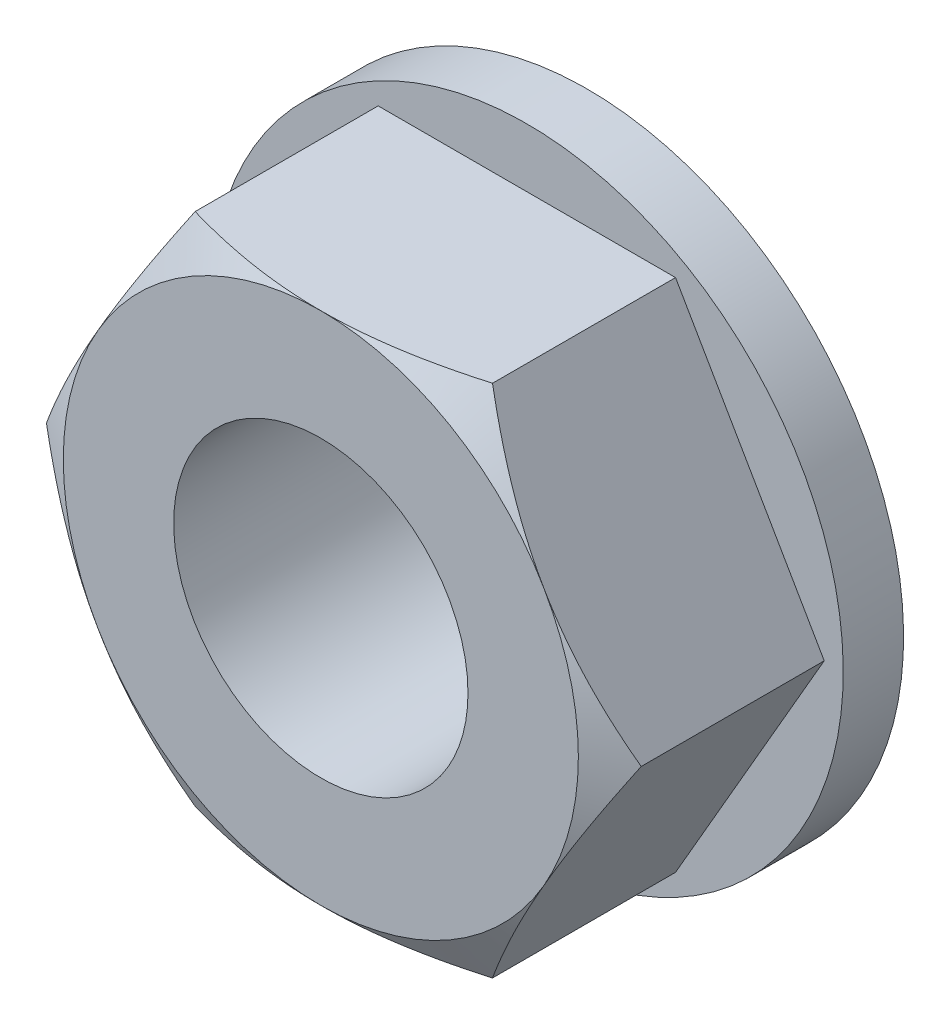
ISO-10303-21;
HEADER;
FILE_DESCRIPTION(('STEP AP214'),'2;1');
FILE_NAME('part.step','',(''),(''),'','','');
FILE_SCHEMA(('AUTOMOTIVE_DESIGN { 1 0 10303 214 1 1 1 1 }'));
ENDSEC;
DATA;
#1=APPLICATION_CONTEXT('core data for automotive mechanical design processes');
#2=APPLICATION_PROTOCOL_DEFINITION('international standard','automotive_design',2000,#1);
#3=PRODUCT_CONTEXT('',#1,'mechanical');
#4=PRODUCT('Part','Part','',(#3));
#5=PRODUCT_RELATED_PRODUCT_CATEGORY('part','',(#4));
#6=PRODUCT_DEFINITION_FORMATION('','',#4);
#7=PRODUCT_DEFINITION_CONTEXT('part definition',#1,'design');
#8=PRODUCT_DEFINITION('design','',#6,#7);
#9=PRODUCT_DEFINITION_SHAPE('','',#8);
#10=(LENGTH_UNIT() NAMED_UNIT(*) SI_UNIT(.MILLI.,.METRE.));
#11=(NAMED_UNIT(*) PLANE_ANGLE_UNIT() SI_UNIT($,.RADIAN.));
#12=(NAMED_UNIT(*) SI_UNIT($,.STERADIAN.) SOLID_ANGLE_UNIT());
#13=UNCERTAINTY_MEASURE_WITH_UNIT(LENGTH_MEASURE(1.E-05),#10,'distance_accuracy_value','');
#14=(GEOMETRIC_REPRESENTATION_CONTEXT(3) GLOBAL_UNCERTAINTY_ASSIGNED_CONTEXT((#13)) GLOBAL_UNIT_ASSIGNED_CONTEXT((#10,
#11,#12)) REPRESENTATION_CONTEXT('',''));
#15=CARTESIAN_POINT('',(0.,0.,0.));
#16=DIRECTION('',(0.,0.,1.));
#17=DIRECTION('',(1.,0.,0.));
#18=AXIS2_PLACEMENT_3D('',#15,#16,#17);
#19=CARTESIAN_POINT('',(0.,0.,0.));
#20=DIRECTION('',(0.,0.,1.));
#21=DIRECTION('',(-0.999860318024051,-0.0167136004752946,0.));
#22=AXIS2_PLACEMENT_3D('',#19,#20,#21);
#23=PLANE('',#22);
#24=CARTESIAN_POINT('',(0.,0.,0.));
#25=DIRECTION('',(0.,0.,-1.));
#26=DIRECTION('',(0.999860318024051,0.0167136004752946,0.));
#27=AXIS2_PLACEMENT_3D('',#24,#25,#26);
#28=CIRCLE('',#27,2.2);
#29=CARTESIAN_POINT('',(2.19969269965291,0.0367699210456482,0.));
#30=VERTEX_POINT('',#29);
#31=EDGE_CURVE('E257',#30,#30,#28,.F.);
#32=ORIENTED_EDGE('',*,*,#31,.T.);
#33=EDGE_LOOP('',(#32));
#34=FACE_BOUND('',#33,.T.);
#35=CARTESIAN_POINT('',(0.,0.,0.));
#36=DIRECTION('',(0.,0.,-1.));
#37=DIRECTION('',(0.999860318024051,0.0167136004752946,0.));
#38=AXIS2_PLACEMENT_3D('',#35,#36,#37);
#39=CIRCLE('',#38,4.3);
#40=CARTESIAN_POINT('',(4.29939936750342,0.071868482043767,0.));
#41=VERTEX_POINT('',#40);
#42=EDGE_CURVE('E20',#41,#41,#39,.F.);
#43=ORIENTED_EDGE('',*,*,#42,.F.);
#44=EDGE_LOOP('',(#43));
#45=FACE_BOUND('',#44,.T.);
#46=ADVANCED_FACE('F17',(#34,#45),#23,.F.);
#47=CARTESIAN_POINT('',(0.,0.,0.82));
#48=DIRECTION('',(0.,0.,-1.));
#49=DIRECTION('',(0.999860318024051,0.0167136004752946,0.));
#50=AXIS2_PLACEMENT_3D('',#47,#48,#49);
#51=CYLINDRICAL_SURFACE('',#50,2.2);
#52=CARTESIAN_POINT('',(0.,0.,0.42));
#53=DIRECTION('',(0.,0.,-1.));
#54=DIRECTION('',(0.,1.,0.));
#55=AXIS2_PLACEMENT_3D('',#52,#53,#54);
#56=CIRCLE('',#55,2.2);
#57=CARTESIAN_POINT('',(0.,2.2,0.419999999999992));
#58=VERTEX_POINT('',#57);
#59=EDGE_CURVE('E11',#58,#58,#56,.T.);
#60=ORIENTED_EDGE('',*,*,#59,.F.);
#61=EDGE_LOOP('',(#60));
#62=FACE_BOUND('',#61,.T.);
#63=ORIENTED_EDGE('',*,*,#31,.F.);
#64=EDGE_LOOP('',(#63));
#65=FACE_BOUND('',#64,.T.);
#66=ADVANCED_FACE('F452',(#62,#65),#51,.F.);
#67=CARTESIAN_POINT('',(0.,0.,0.82));
#68=DIRECTION('',(0.,0.,-1.));
#69=DIRECTION('',(0.999860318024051,0.0167136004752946,0.));
#70=AXIS2_PLACEMENT_3D('',#67,#68,#69);
#71=CYLINDRICAL_SURFACE('',#70,4.3);
#72=ORIENTED_EDGE('',*,*,#42,.T.);
#73=EDGE_LOOP('',(#72));
#74=FACE_BOUND('',#73,.T.);
#75=CARTESIAN_POINT('',(0.,0.,0.82));
#76=DIRECTION('',(0.,0.,-1.));
#77=DIRECTION('',(0.999860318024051,0.0167136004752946,0.));
#78=AXIS2_PLACEMENT_3D('',#75,#76,#77);
#79=CIRCLE('',#78,4.3);
#80=CARTESIAN_POINT('',(4.29939936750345,0.0718684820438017,0.819999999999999));
#81=VERTEX_POINT('',#80);
#82=EDGE_CURVE('E475',#81,#81,#79,.F.);
#83=ORIENTED_EDGE('',*,*,#82,.F.);
#84=EDGE_LOOP('',(#83));
#85=FACE_BOUND('',#84,.T.);
#86=ADVANCED_FACE('F246',(#74,#85),#71,.T.);
#87=CARTESIAN_POINT('',(0.,0.,0.82));
#88=DIRECTION('',(0.,0.,1.));
#89=DIRECTION('',(-0.999860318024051,-0.0167136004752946,0.));
#90=AXIS2_PLACEMENT_3D('',#87,#88,#89);
#91=PLANE('',#90);
#92=ORIENTED_EDGE('',*,*,#82,.T.);
#93=EDGE_LOOP('',(#92));
#94=FACE_BOUND('',#93,.T.);
#95=DIRECTION('',(-0.5,0.866025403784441,0.));
#96=VECTOR('',#95,1.);
#97=CARTESIAN_POINT('',(4.04145188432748,0.,0.820000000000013));
#98=LINE('',#97,#96);
#99=CARTESIAN_POINT('',(4.04145188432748,0.,0.820000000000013));
#100=VERTEX_POINT('',#99);
#101=CARTESIAN_POINT('',(2.02072594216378,3.50000000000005,0.819999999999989));
#102=VERTEX_POINT('',#101);
#103=EDGE_CURVE('E285',#100,#102,#98,.T.);
#104=ORIENTED_EDGE('',*,*,#103,.F.);
#105=DIRECTION('',(0.5,0.866025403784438,0.));
#106=VECTOR('',#105,1.);
#107=CARTESIAN_POINT('',(4.04145188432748,0.,0.820000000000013));
#108=LINE('',#107,#106);
#109=CARTESIAN_POINT('',(2.02072594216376,-3.5,0.819999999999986));
#110=VERTEX_POINT('',#109);
#111=EDGE_CURVE('E280',#100,#110,#108,.F.);
#112=ORIENTED_EDGE('',*,*,#111,.T.);
#113=DIRECTION('',(1.,0.,0.));
#114=VECTOR('',#113,1.);
#115=CARTESIAN_POINT('',(-2.02072594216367,-3.5,0.82));
#116=LINE('',#115,#114);
#117=CARTESIAN_POINT('',(-2.02072594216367,-3.5,0.82));
#118=VERTEX_POINT('',#117);
#119=EDGE_CURVE('E275',#118,#110,#116,.T.);
#120=ORIENTED_EDGE('',*,*,#119,.F.);
#121=DIRECTION('',(0.5,-0.866025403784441,0.));
#122=VECTOR('',#121,1.);
#123=CARTESIAN_POINT('',(-4.04145188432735,0.,0.820000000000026));
#124=LINE('',#123,#122);
#125=CARTESIAN_POINT('',(-4.04145188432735,0.,0.820000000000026));
#126=VERTEX_POINT('',#125);
#127=EDGE_CURVE('E270',#126,#118,#124,.T.);
#128=ORIENTED_EDGE('',*,*,#127,.F.);
#129=DIRECTION('',(0.5,0.866025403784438,0.));
#130=VECTOR('',#129,1.);
#131=CARTESIAN_POINT('',(-2.02072594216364,3.5,0.819999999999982));
#132=LINE('',#131,#130);
#133=CARTESIAN_POINT('',(-2.02072594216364,3.5,0.819999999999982));
#134=VERTEX_POINT('',#133);
#135=EDGE_CURVE('E265',#134,#126,#132,.F.);
#136=ORIENTED_EDGE('',*,*,#135,.F.);
#137=DIRECTION('',(-1.,0.,0.));
#138=VECTOR('',#137,1.);
#139=CARTESIAN_POINT('',(2.02072594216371,3.50000000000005,0.819999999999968));
#140=LINE('',#139,#138);
#141=EDGE_CURVE('E91',#102,#134,#140,.T.);
#142=ORIENTED_EDGE('',*,*,#141,.F.);
#143=EDGE_LOOP('',(#104,#112,#120,#128,#136,#142));
#144=FACE_BOUND('',#143,.T.);
#145=ADVANCED_FACE('F238',(#94,#144),#91,.T.);
#146=CARTESIAN_POINT('',(0.,0.,-21.4175057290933));
#147=DIRECTION('',(0.,0.,1.));
#148=DIRECTION('',(0.866025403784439,-0.5,0.));
#149=AXIS2_PLACEMENT_3D('',#146,#147,#148);
#150=CYLINDRICAL_SURFACE('',#149,2.);
#151=CARTESIAN_POINT('',(0.,0.,0.42));
#152=DIRECTION('',(0.,0.,1.));
#153=DIRECTION('',(0.866025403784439,-0.5,0.));
#154=AXIS2_PLACEMENT_3D('',#151,#152,#153);
#155=CIRCLE('',#154,2.);
#156=CARTESIAN_POINT('',(1.7320508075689,-0.999999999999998,0.420000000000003));
#157=VERTEX_POINT('',#156);
#158=EDGE_CURVE('E156',#157,#157,#155,.T.);
#159=ORIENTED_EDGE('',*,*,#158,.F.);
#160=EDGE_LOOP('',(#159));
#161=FACE_BOUND('',#160,.T.);
#162=CARTESIAN_POINT('',(1.52655665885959E-13,0.,3.62));
#163=DIRECTION('',(0.,0.,1.));
#164=DIRECTION('',(1.,0.,0.));
#165=AXIS2_PLACEMENT_3D('',#162,#163,#164);
#166=CIRCLE('',#165,2.);
#167=CARTESIAN_POINT('',(2.00000000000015,0.,3.62));
#168=VERTEX_POINT('',#167);
#169=EDGE_CURVE('E254',#168,#168,#166,.T.);
#170=ORIENTED_EDGE('',*,*,#169,.T.);
#171=EDGE_LOOP('',(#170));
#172=FACE_BOUND('',#171,.T.);
#173=ADVANCED_FACE('F164',(#161,#172),#150,.F.);
#174=CARTESIAN_POINT('',(2.02072594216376,3.5,0.419999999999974));
#175=DIRECTION('',(0.,0.,-1.));
#176=DIRECTION('',(-0.866025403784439,0.5,0.));
#177=AXIS2_PLACEMENT_3D('',#174,#175,#176);
#178=PLANE('',#177);
#179=ORIENTED_EDGE('',*,*,#158,.T.);
#180=EDGE_LOOP('',(#179));
#181=FACE_BOUND('',#180,.T.);
#182=ORIENTED_EDGE('',*,*,#59,.T.);
#183=EDGE_LOOP('',(#182));
#184=FACE_BOUND('',#183,.T.);
#185=ADVANCED_FACE('F237',(#181,#184),#178,.T.);
#186=CARTESIAN_POINT('',(2.02072594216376,3.5,3.62));
#187=DIRECTION('',(0.,0.,-1.));
#188=DIRECTION('',(-0.866025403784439,0.5,0.));
#189=AXIS2_PLACEMENT_3D('',#186,#187,#188);
#190=PLANE('',#189);
#191=CARTESIAN_POINT('',(1.38777878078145E-13,0.,3.62000000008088));
#192=DIRECTION('',(0.,0.,-1.));
#193=DIRECTION('',(-0.866025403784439,0.5,0.));
#194=AXIS2_PLACEMENT_3D('',#191,#192,#193);
#195=CIRCLE('',#194,3.49999999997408);
#196=CARTESIAN_POINT('',(-3.03108891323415,-1.74999999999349,3.62000000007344));
#197=VERTEX_POINT('',#196);
#198=CARTESIAN_POINT('',(-3.03108891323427,1.74999999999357,3.62000000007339));
#199=VERTEX_POINT('',#198);
#200=EDGE_CURVE('E312',#197,#199,#195,.T.);
#201=ORIENTED_EDGE('',*,*,#200,.F.);
#202=CARTESIAN_POINT('',(1.38777878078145E-13,0.,3.62000000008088));
#203=DIRECTION('',(0.,0.,-1.));
#204=DIRECTION('',(-0.866025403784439,0.5,0.));
#205=AXIS2_PLACEMENT_3D('',#202,#203,#204);
#206=CIRCLE('',#205,3.49999999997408);
#207=CARTESIAN_POINT('',(1.45716771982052E-13,-3.49999999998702,3.62000000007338));
#208=VERTEX_POINT('',#207);
#209=EDGE_CURVE('E315',#208,#197,#206,.T.);
#210=ORIENTED_EDGE('',*,*,#209,.F.);
#211=CARTESIAN_POINT('',(1.38777878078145E-13,0.,3.62000000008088));
#212=DIRECTION('',(0.,0.,-1.));
#213=DIRECTION('',(-0.866025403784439,0.5,0.));
#214=AXIS2_PLACEMENT_3D('',#211,#212,#213);
#215=CIRCLE('',#214,3.49999999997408);
#216=CARTESIAN_POINT('',(3.03108891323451,-1.74999999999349,3.62000000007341));
#217=VERTEX_POINT('',#216);
#218=EDGE_CURVE('E104',#217,#208,#215,.T.);
#219=ORIENTED_EDGE('',*,*,#218,.F.);
#220=CARTESIAN_POINT('',(1.38777878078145E-13,0.,3.62000000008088));
#221=DIRECTION('',(0.,0.,-1.));
#222=DIRECTION('',(-0.866025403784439,0.5,0.));
#223=AXIS2_PLACEMENT_3D('',#220,#221,#222);
#224=CIRCLE('',#223,3.49999999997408);
#225=CARTESIAN_POINT('',(3.0310889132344,1.74999999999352,3.62000000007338));
#226=VERTEX_POINT('',#225);
#227=EDGE_CURVE('E73',#226,#217,#224,.T.);
#228=ORIENTED_EDGE('',*,*,#227,.F.);
#229=CARTESIAN_POINT('',(1.38777878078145E-13,0.,3.62000000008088));
#230=DIRECTION('',(0.,0.,-1.));
#231=DIRECTION('',(-0.866025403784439,0.5,0.));
#232=AXIS2_PLACEMENT_3D('',#229,#230,#231);
#233=CIRCLE('',#232,3.49999999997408);
#234=CARTESIAN_POINT('',(0.,3.49999999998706,3.62000000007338));
#235=VERTEX_POINT('',#234);
#236=EDGE_CURVE('E100',#235,#226,#233,.T.);
#237=ORIENTED_EDGE('',*,*,#236,.F.);
#238=CARTESIAN_POINT('',(1.38777878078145E-13,0.,3.62000000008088));
#239=DIRECTION('',(0.,0.,-1.));
#240=DIRECTION('',(-0.866025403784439,0.5,0.));
#241=AXIS2_PLACEMENT_3D('',#238,#239,#240);
#242=CIRCLE('',#241,3.49999999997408);
#243=EDGE_CURVE('E26',#199,#235,#242,.T.);
#244=ORIENTED_EDGE('',*,*,#243,.F.);
#245=EDGE_LOOP('',(#201,#210,#219,#228,#237,#244));
#246=FACE_BOUND('',#245,.T.);
#247=ORIENTED_EDGE('',*,*,#169,.F.);
#248=EDGE_LOOP('',(#247));
#249=FACE_BOUND('',#248,.T.);
#250=ADVANCED_FACE('F97',(#246,#249),#190,.F.);
#251=CARTESIAN_POINT('',(1.52655665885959E-13,0.,3.3055169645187));
#252=DIRECTION('',(0.,0.,-1.));
#253=DIRECTION('',(-0.866025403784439,0.5,0.));
#254=AXIS2_PLACEMENT_3D('',#251,#252,#253);
#255=CONICAL_SURFACE('',#254,4.04470059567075,1.04719755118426);
#256=CARTESIAN_POINT('',(3.03108891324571,-1.74999999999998,3.62000000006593));
#257=CARTESIAN_POINT('',(3.07397315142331,-1.67572232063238,3.62001430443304));
#258=CARTESIAN_POINT('',(3.11685532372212,-1.60144821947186,3.61818014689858));
#259=CARTESIAN_POINT('',(3.20253546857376,-1.45304585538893,3.61092122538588));
#260=CARTESIAN_POINT('',(3.24533345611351,-1.37891756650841,3.60549717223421));
#261=CARTESIAN_POINT('',(3.33056879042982,-1.23128563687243,3.59120049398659));
#262=CARTESIAN_POINT('',(3.37300687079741,-1.15778072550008,3.58234522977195));
#263=CARTESIAN_POINT('',(3.45768084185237,-1.01112110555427,3.56137660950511));
#264=CARTESIAN_POINT('',(3.49991672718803,-0.937966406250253,3.54926316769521));
#265=CARTESIAN_POINT('',(3.62614601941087,-0.719330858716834,3.50840979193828));
#266=CARTESIAN_POINT('',(3.70977272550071,-0.574485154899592,3.47513697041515));
#267=CARTESIAN_POINT('',(3.87630698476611,-0.286039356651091,3.39840133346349));
#268=CARTESIAN_POINT('',(3.95920872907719,-0.14244932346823,3.35488762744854));
#269=CARTESIAN_POINT('',(4.04145184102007,-7.50106261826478E-08,3.30739263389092));
#270=B_SPLINE_CURVE_WITH_KNOTS('',3,(#256,#257,#258,#259,#260,#261,#262,#263,#264,#265,#266,
#267,#268,#269),.UNSPECIFIED.,.F.,.F.,(4,2,2,2,2,2,4),(0.,0.257279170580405,0.514507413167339,
0.77045080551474,1.02640093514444,1.537630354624,2.05145599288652),.UNSPECIFIED.);
#271=CARTESIAN_POINT('',(4.04145186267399,-3.75049696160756E-08,3.30739262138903));
#272=VERTEX_POINT('',#271);
#273=EDGE_CURVE('E75',#217,#272,#270,.T.);
#274=ORIENTED_EDGE('',*,*,#273,.T.);
#275=CARTESIAN_POINT('',(4.04145190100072,-2.88788541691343E-08,3.30739259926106));
#276=CARTESIAN_POINT('',(3.95920878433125,0.142449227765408,3.35488759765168));
#277=CARTESIAN_POINT('',(3.87630703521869,0.286039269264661,3.3984013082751));
#278=CARTESIAN_POINT('',(3.70977276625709,0.574485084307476,3.47513695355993));
#279=CARTESIAN_POINT('',(3.62614605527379,0.719330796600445,3.50840977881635));
#280=CARTESIAN_POINT('',(3.49991675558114,0.937966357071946,3.54926315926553));
#281=CARTESIAN_POINT('',(3.45768086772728,1.01112106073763,3.56137660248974));
#282=CARTESIAN_POINT('',(3.37300689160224,1.15778068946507,3.58234522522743));
#283=CARTESIAN_POINT('',(3.33056880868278,1.23128560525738,3.59120049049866));
#284=CARTESIAN_POINT('',(3.24533346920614,1.37891754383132,3.60549717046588));
#285=CARTESIAN_POINT('',(3.20253547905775,1.45304583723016,3.61092122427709));
#286=CARTESIAN_POINT('',(3.11685532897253,1.60144821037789,3.6181801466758));
#287=CARTESIAN_POINT('',(3.07397315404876,1.67572231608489,3.62001430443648));
#288=CARTESIAN_POINT('',(3.03108891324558,1.75,3.6200000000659));
#289=B_SPLINE_CURVE_WITH_KNOTS('',3,(#275,#276,#277,#278,#279,#280,#281,#282,#283,#284,#285,
#286,#287,#288),.UNSPECIFIED.,.F.,.F.,(4,2,2,2,2,2,4),(0.,0.513825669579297,1.02505511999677,
1.28100526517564,1.53694867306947,1.79417693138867,2.05145611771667),.UNSPECIFIED.);
#290=EDGE_CURVE('E69',#272,#226,#289,.T.);
#291=ORIENTED_EDGE('',*,*,#290,.T.);
#292=ORIENTED_EDGE('',*,*,#227,.T.);
#293=EDGE_LOOP('',(#274,#291,#292));
#294=FACE_BOUND('',#293,.T.);
#295=ADVANCED_FACE('F71',(#294),#255,.T.);
#296=CARTESIAN_POINT('',(1.52655665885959E-13,0.,3.3055169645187));
#297=DIRECTION('',(0.,0.,-1.));
#298=DIRECTION('',(-0.866025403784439,0.5,0.));
#299=AXIS2_PLACEMENT_3D('',#296,#297,#298);
#300=CONICAL_SURFACE('',#299,4.04470059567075,1.04719755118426);
#301=ORIENTED_EDGE('',*,*,#218,.T.);
#302=CARTESIAN_POINT('',(1.59594559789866E-13,-3.5,3.62000000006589));
#303=CARTESIAN_POINT('',(0.0857684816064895,-3.49999999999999,3.62001430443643));
#304=CARTESIAN_POINT('',(0.171532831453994,-3.49999999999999,3.61818014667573));
#305=CARTESIAN_POINT('',(0.342893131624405,-3.49999999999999,3.61092122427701));
#306=CARTESIAN_POINT('',(0.428489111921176,-3.49999999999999,3.60549717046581));
#307=CARTESIAN_POINT('',(0.598959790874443,-3.49999999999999,3.59120049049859));
#308=CARTESIAN_POINT('',(0.683835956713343,-3.49999999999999,3.58234522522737));
#309=CARTESIAN_POINT('',(0.853183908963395,-3.49999999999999,3.56137660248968));
#310=CARTESIAN_POINT('',(0.93765568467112,-3.49999999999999,3.54926315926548));
#311=CARTESIAN_POINT('',(1.19011428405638,-3.49999999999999,3.5084097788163));
#312=CARTESIAN_POINT('',(1.35736770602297,-3.49999999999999,3.47513695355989));
#313=CARTESIAN_POINT('',(1.69043624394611,-3.49999999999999,3.39840130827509));
#314=CARTESIAN_POINT('',(1.85623974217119,-3.49999999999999,3.3548875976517));
#315=CARTESIAN_POINT('',(2.02072597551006,-3.5,3.30739259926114));
#316=B_SPLINE_CURVE_WITH_KNOTS('',3,(#302,#303,#304,#305,#306,#307,#308,#309,#310,#311,#312,
#313,#314,#315),.UNSPECIFIED.,.F.,.F.,(4,2,2,2,2,2,4),(0.,0.257279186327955,0.514507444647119,
0.770450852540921,1.02640099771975,1.53763044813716,2.05145611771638),.UNSPECIFIED.);
#317=CARTESIAN_POINT('',(2.02072595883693,-3.5,3.30739260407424));
#318=VERTEX_POINT('',#317);
#319=EDGE_CURVE('E189',#208,#318,#316,.T.);
#320=ORIENTED_EDGE('',*,*,#319,.T.);
#321=CARTESIAN_POINT('',(2.02072598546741,-3.49999992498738,3.30739263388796));
#322=CARTESIAN_POINT('',(2.10296909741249,-3.35755067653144,3.35488762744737));
#323=CARTESIAN_POINT('',(2.18587084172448,-3.21396064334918,3.39840133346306));
#324=CARTESIAN_POINT('',(2.35240510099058,-2.925514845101,3.47513697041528));
#325=CARTESIAN_POINT('',(2.43603180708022,-2.78066914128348,3.50840979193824));
#326=CARTESIAN_POINT('',(2.56226109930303,-2.5620335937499,3.54926316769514));
#327=CARTESIAN_POINT('',(2.60449698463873,-2.48887889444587,3.56137660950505));
#328=CARTESIAN_POINT('',(2.68917095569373,-2.34221927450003,3.58234522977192));
#329=CARTESIAN_POINT('',(2.73160903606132,-2.26871436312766,3.59120049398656));
#330=CARTESIAN_POINT('',(2.81684437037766,-2.12108243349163,3.6054971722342));
#331=CARTESIAN_POINT('',(2.85964235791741,-2.04695414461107,3.61092122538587));
#332=CARTESIAN_POINT('',(2.94532250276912,-1.89855178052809,3.61818014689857));
#333=CARTESIAN_POINT('',(2.988204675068,-1.82427767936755,3.62001430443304));
#334=CARTESIAN_POINT('',(3.03108891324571,-1.74999999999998,3.62000000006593));
#335=B_SPLINE_CURVE_WITH_KNOTS('',3,(#321,#322,#323,#324,#325,#326,#327,#328,#329,#330,#331,
#332,#333,#334),.UNSPECIFIED.,.F.,.F.,(4,2,2,2,2,2,4),(0.,0.513825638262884,1.02505505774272,
1.2810051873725,1.53694857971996,1.79417682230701,2.05145599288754),.UNSPECIFIED.);
#336=EDGE_CURVE('E78',#318,#217,#335,.T.);
#337=ORIENTED_EDGE('',*,*,#336,.T.);
#338=EDGE_LOOP('',(#301,#320,#337));
#339=FACE_BOUND('',#338,.T.);
#340=ADVANCED_FACE('F180',(#339),#300,.T.);
#341=CARTESIAN_POINT('',(4.04145188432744,0.,0.420000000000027));
#342=DIRECTION('',(-0.866025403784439,0.5,0.));
#343=DIRECTION('',(0.,0.,1.));
#344=AXIS2_PLACEMENT_3D('',#341,#342,#343);
#345=PLANE('',#344);
#346=DIRECTION('',(0.,0.,1.));
#347=VECTOR('',#346,1.);
#348=CARTESIAN_POINT('',(2.02072594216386,-3.5,0.419999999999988));
#349=LINE('',#348,#347);
#350=EDGE_CURVE('E278',#110,#318,#349,.T.);
#351=ORIENTED_EDGE('',*,*,#350,.F.);
#352=ORIENTED_EDGE('',*,*,#111,.F.);
#353=DIRECTION('',(0.,0.,1.));
#354=VECTOR('',#353,1.);
#355=CARTESIAN_POINT('',(4.04145188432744,0.,0.420000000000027));
#356=LINE('',#355,#354);
#357=EDGE_CURVE('E283',#272,#100,#356,.F.);
#358=ORIENTED_EDGE('',*,*,#357,.F.);
#359=ORIENTED_EDGE('',*,*,#273,.F.);
#360=ORIENTED_EDGE('',*,*,#336,.F.);
#361=EDGE_LOOP('',(#351,#352,#358,#359,#360));
#362=FACE_BOUND('',#361,.T.);
#363=ADVANCED_FACE('F161',(#362),#345,.F.);
#364=CARTESIAN_POINT('',(1.52655665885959E-13,0.,3.3055169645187));
#365=DIRECTION('',(0.,0.,-1.));
#366=DIRECTION('',(-0.866025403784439,0.5,0.));
#367=AXIS2_PLACEMENT_3D('',#364,#365,#366);
#368=CONICAL_SURFACE('',#367,4.04470059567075,1.04719755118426);
#369=CARTESIAN_POINT('',(-3.03108891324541,-1.74999999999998,3.62000000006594));
#370=CARTESIAN_POINT('',(-2.98820467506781,-1.82427767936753,3.62001430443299));
#371=CARTESIAN_POINT('',(-2.945322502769,-1.89855178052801,3.61818014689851));
#372=CARTESIAN_POINT('',(-2.85964235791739,-2.04695414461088,3.6109212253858));
#373=CARTESIAN_POINT('',(-2.81684437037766,-2.12108243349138,3.60549717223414));
#374=CARTESIAN_POINT('',(-2.73160903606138,-2.2687143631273,3.59120049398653));
#375=CARTESIAN_POINT('',(-2.68917095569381,-2.34221927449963,3.5823452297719));
#376=CARTESIAN_POINT('',(-2.60449698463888,-2.48887889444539,3.56137660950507));
#377=CARTESIAN_POINT('',(-2.56226109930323,-2.56203359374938,3.54926316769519));
#378=CARTESIAN_POINT('',(-2.43603180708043,-2.78066914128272,3.50840979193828));
#379=CARTESIAN_POINT('',(-2.35240510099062,-2.92551484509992,3.47513697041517));
#380=CARTESIAN_POINT('',(-2.18587084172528,-3.21396064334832,3.39840133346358));
#381=CARTESIAN_POINT('',(-2.10296909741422,-3.35755067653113,3.35488762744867));
#382=CARTESIAN_POINT('',(-2.02072598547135,-3.49999992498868,3.30739263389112));
#383=B_SPLINE_CURVE_WITH_KNOTS('',3,(#369,#370,#371,#372,#373,#374,#375,#376,#377,#378,#379,
#380,#381,#382),.UNSPECIFIED.,.F.,.F.,(4,2,2,2,2,2,4),(0.,0.257279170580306,0.514507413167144,
0.770450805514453,1.02640093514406,1.53763035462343,2.05145599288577),.UNSPECIFIED.);
#384=CARTESIAN_POINT('',(-2.02072596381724,-3.49999996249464,3.30739262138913));
#385=VERTEX_POINT('',#384);
#386=EDGE_CURVE('E196',#197,#385,#383,.T.);
#387=ORIENTED_EDGE('',*,*,#386,.T.);
#388=CARTESIAN_POINT('',(-2.02072597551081,-3.5,3.30739259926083));
#389=CARTESIAN_POINT('',(-1.85623974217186,-3.49999999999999,3.35488759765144));
#390=CARTESIAN_POINT('',(-1.69043624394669,-3.49999999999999,3.39840130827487));
#391=CARTESIAN_POINT('',(-1.35736770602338,-3.49999999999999,3.47513695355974));
#392=CARTESIAN_POINT('',(-1.1901142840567,-3.49999999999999,3.50840977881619));
#393=CARTESIAN_POINT('',(-0.937655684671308,-3.49999999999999,3.5492631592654));
#394=CARTESIAN_POINT('',(-0.853183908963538,-3.49999999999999,3.56137660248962));
#395=CARTESIAN_POINT('',(-0.683835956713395,-3.49999999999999,3.58234522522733));
#396=CARTESIAN_POINT('',(-0.59895979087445,-3.49999999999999,3.59120049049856));
#397=CARTESIAN_POINT('',(-0.42848911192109,-3.49999999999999,3.6054971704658));
#398=CARTESIAN_POINT('',(-0.342893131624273,-3.49999999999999,3.610921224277));
#399=CARTESIAN_POINT('',(-0.171532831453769,-3.49999999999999,3.61818014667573));
#400=CARTESIAN_POINT('',(-0.0857684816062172,-3.49999999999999,3.62001430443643));
#401=CARTESIAN_POINT('',(1.59594559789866E-13,-3.5,3.62000000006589));
#402=B_SPLINE_CURVE_WITH_KNOTS('',3,(#388,#389,#390,#391,#392,#393,#394,#395,#396,#397,#398,
#399,#400,#401),.UNSPECIFIED.,.F.,.F.,(4,2,2,2,2,2,4),(0.,0.513825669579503,1.02505511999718,
1.28100526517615,1.53694867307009,1.7941769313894,2.05145611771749),.UNSPECIFIED.);
#403=EDGE_CURVE('E209',#385,#208,#402,.T.);
#404=ORIENTED_EDGE('',*,*,#403,.T.);
#405=ORIENTED_EDGE('',*,*,#209,.T.);
#406=EDGE_LOOP('',(#387,#404,#405));
#407=FACE_BOUND('',#406,.T.);
#408=ADVANCED_FACE('F186',(#407),#368,.T.);
#409=CARTESIAN_POINT('',(-2.02072594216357,-3.5,0.419999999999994));
#410=DIRECTION('',(0.,-1.,0.));
#411=DIRECTION('',(1.,0.,0.));
#412=AXIS2_PLACEMENT_3D('',#409,#410,#411);
#413=PLANE('',#412);
#414=DIRECTION('',(0.,0.,1.));
#415=VECTOR('',#414,1.);
#416=CARTESIAN_POINT('',(-2.02072594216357,-3.5,0.419999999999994));
#417=LINE('',#416,#415);
#418=EDGE_CURVE('E273',#118,#385,#417,.T.);
#419=ORIENTED_EDGE('',*,*,#418,.F.);
#420=ORIENTED_EDGE('',*,*,#119,.T.);
#421=ORIENTED_EDGE('',*,*,#350,.T.);
#422=ORIENTED_EDGE('',*,*,#319,.F.);
#423=ORIENTED_EDGE('',*,*,#403,.F.);
#424=EDGE_LOOP('',(#419,#420,#421,#422,#423));
#425=FACE_BOUND('',#424,.T.);
#426=ADVANCED_FACE('F202',(#425),#413,.T.);
#427=CARTESIAN_POINT('',(1.52655665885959E-13,0.,3.3055169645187));
#428=DIRECTION('',(0.,0.,-1.));
#429=DIRECTION('',(-0.866025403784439,0.5,0.));
#430=AXIS2_PLACEMENT_3D('',#427,#428,#429);
#431=CONICAL_SURFACE('',#430,4.04470059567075,1.04719755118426);
#432=CARTESIAN_POINT('',(-3.03108891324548,1.75000000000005,3.62000000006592));
#433=CARTESIAN_POINT('',(-3.0739731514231,1.67572232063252,3.62001430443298));
#434=CARTESIAN_POINT('',(-3.11685532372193,1.60144821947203,3.6181801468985));
#435=CARTESIAN_POINT('',(-3.20253546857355,1.45304585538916,3.61092122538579));
#436=CARTESIAN_POINT('',(-3.24533345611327,1.37891756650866,3.60549717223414));
#437=CARTESIAN_POINT('',(-3.33056879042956,1.23128563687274,3.59120049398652));
#438=CARTESIAN_POINT('',(-3.37300687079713,1.15778072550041,3.58234522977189));
#439=CARTESIAN_POINT('',(-3.45768084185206,1.01112110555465,3.56137660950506));
#440=CARTESIAN_POINT('',(-3.49991672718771,0.937966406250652,3.54926316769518));
#441=CARTESIAN_POINT('',(-3.62614601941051,0.719330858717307,3.50840979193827));
#442=CARTESIAN_POINT('',(-3.70977272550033,0.574485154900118,3.47513697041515));
#443=CARTESIAN_POINT('',(-3.87630698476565,0.286039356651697,3.39840133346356));
#444=CARTESIAN_POINT('',(-3.95920872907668,0.142449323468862,3.35488762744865));
#445=CARTESIAN_POINT('',(-4.04145184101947,7.50112489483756E-08,3.30739263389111));
#446=B_SPLINE_CURVE_WITH_KNOTS('',3,(#432,#433,#434,#435,#436,#437,#438,#439,#440,#441,#442,
#443,#444,#445),.UNSPECIFIED.,.F.,.F.,(4,2,2,2,2,2,4),(0.,0.257279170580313,0.514507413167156,
0.770450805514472,1.02640093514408,1.53763035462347,2.05145599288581),.UNSPECIFIED.);
#447=CARTESIAN_POINT('',(-4.04145186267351,3.75053408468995E-08,3.30739262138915));
#448=VERTEX_POINT('',#447);
#449=EDGE_CURVE('E215',#199,#448,#446,.T.);
#450=ORIENTED_EDGE('',*,*,#449,.T.);
#451=CARTESIAN_POINT('',(-4.04145190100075,2.88795029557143E-08,3.30739259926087));
#452=CARTESIAN_POINT('',(-3.95920878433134,-0.142449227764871,3.35488759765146));
#453=CARTESIAN_POINT('',(-3.87630703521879,-0.286039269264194,3.39840130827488));
#454=CARTESIAN_POINT('',(-3.70977276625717,-0.574485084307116,3.47513695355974));
#455=CARTESIAN_POINT('',(-3.62614605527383,-0.719330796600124,3.50840977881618));
#456=CARTESIAN_POINT('',(-3.49991675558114,-0.937966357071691,3.54926315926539));
#457=CARTESIAN_POINT('',(-3.45768086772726,-1.0111210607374,3.5613766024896));
#458=CARTESIAN_POINT('',(-3.37300689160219,-1.15778068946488,3.58234522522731));
#459=CARTESIAN_POINT('',(-3.33056880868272,-1.23128560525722,3.59120049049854));
#460=CARTESIAN_POINT('',(-3.24533346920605,-1.3789175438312,3.60549717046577));
#461=CARTESIAN_POINT('',(-3.20253547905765,-1.45304583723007,3.61092122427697));
#462=CARTESIAN_POINT('',(-3.1168553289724,-1.60144821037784,3.61818014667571));
#463=CARTESIAN_POINT('',(-3.07397315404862,-1.67572231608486,3.62001430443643));
#464=CARTESIAN_POINT('',(-3.03108891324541,-1.74999999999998,3.62000000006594));
#465=B_SPLINE_CURVE_WITH_KNOTS('',3,(#451,#452,#453,#454,#455,#456,#457,#458,#459,#460,#461,
#462,#463,#464),.UNSPECIFIED.,.F.,.F.,(4,2,2,2,2,2,4),(0.,0.513825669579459,1.0250551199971,
1.28100526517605,1.53694867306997,1.79417693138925,2.05145611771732),.UNSPECIFIED.);
#466=EDGE_CURVE('E221',#448,#197,#465,.T.);
#467=ORIENTED_EDGE('',*,*,#466,.T.);
#468=ORIENTED_EDGE('',*,*,#200,.T.);
#469=EDGE_LOOP('',(#450,#467,#468));
#470=FACE_BOUND('',#469,.T.);
#471=ADVANCED_FACE('F205',(#470),#431,.T.);
#472=CARTESIAN_POINT('',(-4.0414518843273,0.,0.420000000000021));
#473=DIRECTION('',(-0.866025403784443,-0.5,0.));
#474=DIRECTION('',(0.5,-0.866025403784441,0.));
#475=AXIS2_PLACEMENT_3D('',#472,#473,#474);
#476=PLANE('',#475);
#477=DIRECTION('',(0.,0.,1.));
#478=VECTOR('',#477,1.);
#479=CARTESIAN_POINT('',(-4.0414518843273,0.,0.420000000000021));
#480=LINE('',#479,#478);
#481=EDGE_CURVE('E268',#126,#448,#480,.T.);
#482=ORIENTED_EDGE('',*,*,#481,.F.);
#483=ORIENTED_EDGE('',*,*,#127,.T.);
#484=ORIENTED_EDGE('',*,*,#418,.T.);
#485=ORIENTED_EDGE('',*,*,#386,.F.);
#486=ORIENTED_EDGE('',*,*,#466,.F.);
#487=EDGE_LOOP('',(#482,#483,#484,#485,#486));
#488=FACE_BOUND('',#487,.T.);
#489=ADVANCED_FACE('F160',(#488),#476,.T.);
#490=CARTESIAN_POINT('',(4.04145188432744,0.,0.420000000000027));
#491=DIRECTION('',(0.866025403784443,0.5,0.));
#492=DIRECTION('',(-0.5,0.866025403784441,0.));
#493=AXIS2_PLACEMENT_3D('',#490,#491,#492);
#494=PLANE('',#493);
#495=ORIENTED_EDGE('',*,*,#357,.T.);
#496=ORIENTED_EDGE('',*,*,#103,.T.);
#497=DIRECTION('',(0.,0.,1.));
#498=VECTOR('',#497,1.);
#499=CARTESIAN_POINT('',(2.0207259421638,3.5,0.419999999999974));
#500=LINE('',#499,#498);
#501=CARTESIAN_POINT('',(2.02072596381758,3.49999996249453,3.30739262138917));
#502=VERTEX_POINT('',#501);
#503=EDGE_CURVE('E86',#502,#102,#500,.F.);
#504=ORIENTED_EDGE('',*,*,#503,.F.);
#505=CARTESIAN_POINT('',(3.03108891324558,1.75,3.6200000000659));
#506=CARTESIAN_POINT('',(2.98820467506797,1.82427767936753,3.62001430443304));
#507=CARTESIAN_POINT('',(2.94532250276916,1.898551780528,3.61818014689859));
#508=CARTESIAN_POINT('',(2.85964235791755,2.04695414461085,3.61092122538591));
#509=CARTESIAN_POINT('',(2.81684437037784,2.12108243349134,3.60549717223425));
#510=CARTESIAN_POINT('',(2.73160903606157,2.26871436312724,3.59120049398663));
#511=CARTESIAN_POINT('',(2.689170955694,2.34221927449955,3.582345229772));
#512=CARTESIAN_POINT('',(2.60449698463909,2.48887889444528,3.56137660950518));
#513=CARTESIAN_POINT('',(2.56226109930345,2.56203359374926,3.5492631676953));
#514=CARTESIAN_POINT('',(2.43603180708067,2.78066914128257,3.50840979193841));
#515=CARTESIAN_POINT('',(2.35240510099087,2.92551484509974,3.47513697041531));
#516=CARTESIAN_POINT('',(2.18587084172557,3.21396064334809,3.39840133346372));
#517=CARTESIAN_POINT('',(2.10296909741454,3.35755067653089,3.3548876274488));
#518=CARTESIAN_POINT('',(2.02072598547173,3.49999992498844,3.3073926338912));
#519=B_SPLINE_CURVE_WITH_KNOTS('',3,(#505,#506,#507,#508,#509,#510,#511,#512,#513,#514,#515,
#516,#517,#518),.UNSPECIFIED.,.F.,.F.,(4,2,2,2,2,2,4),(0.,0.257279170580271,0.514507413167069,
0.770450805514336,1.0264009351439,1.53763035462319,2.05145599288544),.UNSPECIFIED.);
#520=EDGE_CURVE('E82',#226,#502,#519,.T.);
#521=ORIENTED_EDGE('',*,*,#520,.F.);
#522=ORIENTED_EDGE('',*,*,#290,.F.);
#523=EDGE_LOOP('',(#495,#496,#504,#521,#522));
#524=FACE_BOUND('',#523,.T.);
#525=ADVANCED_FACE('F83',(#524),#494,.T.);
#526=CARTESIAN_POINT('',(1.52655665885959E-13,0.,3.3055169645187));
#527=DIRECTION('',(0.,0.,-1.));
#528=DIRECTION('',(-0.866025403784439,0.5,0.));
#529=AXIS2_PLACEMENT_3D('',#526,#527,#528);
#530=CONICAL_SURFACE('',#529,4.04470059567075,1.04719755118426);
#531=ORIENTED_EDGE('',*,*,#520,.T.);
#532=CARTESIAN_POINT('',(2.02072597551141,3.5,3.30739259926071));
#533=CARTESIAN_POINT('',(1.85623974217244,3.50000000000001,3.35488759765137));
#534=CARTESIAN_POINT('',(1.69043624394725,3.50000000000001,3.39840130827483));
#535=CARTESIAN_POINT('',(1.35736770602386,3.50000000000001,3.47513695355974));
#536=CARTESIAN_POINT('',(1.19011428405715,3.50000000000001,3.50840977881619));
#537=CARTESIAN_POINT('',(0.937655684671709,3.50000000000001,3.54926315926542));
#538=CARTESIAN_POINT('',(0.853183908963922,3.50000000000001,3.56137660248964));
#539=CARTESIAN_POINT('',(0.683835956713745,3.50000000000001,3.58234522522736));
#540=CARTESIAN_POINT('',(0.598959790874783,3.50000000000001,3.59120049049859));
#541=CARTESIAN_POINT('',(0.428489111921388,3.50000000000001,3.60549717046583));
#542=CARTESIAN_POINT('',(0.342893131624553,3.50000000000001,3.61092122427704));
#543=CARTESIAN_POINT('',(0.171532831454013,3.50000000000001,3.61818014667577));
#544=CARTESIAN_POINT('',(0.0857684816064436,3.50000000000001,3.62001430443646));
#545=CARTESIAN_POINT('',(0.,3.5,3.62000000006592));
#546=B_SPLINE_CURVE_WITH_KNOTS('',3,(#532,#533,#534,#535,#536,#537,#538,#539,#540,#541,#542,
#543,#544,#545),.UNSPECIFIED.,.F.,.F.,(4,2,2,2,2,2,4),(0.,0.513825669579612,1.02505511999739,
1.28100526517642,1.53694867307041,1.79417693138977,2.05145611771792),.UNSPECIFIED.);
#547=EDGE_CURVE('E90',#502,#235,#546,.T.);
#548=ORIENTED_EDGE('',*,*,#547,.T.);
#549=ORIENTED_EDGE('',*,*,#236,.T.);
#550=EDGE_LOOP('',(#531,#548,#549));
#551=FACE_BOUND('',#550,.T.);
#552=ADVANCED_FACE('F106',(#551),#530,.T.);
#553=CARTESIAN_POINT('',(1.52655665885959E-13,0.,3.3055169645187));
#554=DIRECTION('',(0.,0.,-1.));
#555=DIRECTION('',(-0.866025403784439,0.5,0.));
#556=AXIS2_PLACEMENT_3D('',#553,#554,#555);
#557=CONICAL_SURFACE('',#556,4.04470059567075,1.04719755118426);
#558=ORIENTED_EDGE('',*,*,#243,.T.);
#559=CARTESIAN_POINT('',(0.,3.5,3.62000000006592));
#560=CARTESIAN_POINT('',(-0.0857684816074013,3.50000000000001,3.62001430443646));
#561=CARTESIAN_POINT('',(-0.171532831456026,3.50000000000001,3.61818014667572));
#562=CARTESIAN_POINT('',(-0.342893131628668,3.50000000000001,3.6109212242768));
#563=CARTESIAN_POINT('',(-0.428489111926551,3.50000000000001,3.60549717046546));
#564=CARTESIAN_POINT('',(-0.598959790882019,3.50000000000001,3.59120049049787));
#565=CARTESIAN_POINT('',(-0.683835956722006,3.50000000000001,3.58234522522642));
#566=CARTESIAN_POINT('',(-0.853183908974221,3.50000000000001,3.5613766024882));
#567=CARTESIAN_POINT('',(-0.937655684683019,3.50000000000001,3.5492631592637));
#568=CARTESIAN_POINT('',(-1.19011428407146,3.50000000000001,3.50840977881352));
#569=CARTESIAN_POINT('',(-1.35736770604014,3.50000000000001,3.47513695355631));
#570=CARTESIAN_POINT('',(-1.69043624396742,3.50000000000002,3.39840130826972));
#571=CARTESIAN_POINT('',(-1.85623974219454,3.50000000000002,3.35488759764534));
#572=CARTESIAN_POINT('',(-2.02072597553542,3.50000000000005,3.30739259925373));
#573=B_SPLINE_CURVE_WITH_KNOTS('',3,(#559,#560,#561,#562,#563,#564,#565,#566,#567,#568,#569,
#570,#571,#572),.UNSPECIFIED.,.F.,.F.,(4,2,2,2,2,2,4),(0.,0.257279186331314,0.514507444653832,
0.770450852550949,1.0264009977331,1.53763044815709,2.051456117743),.UNSPECIFIED.);
#574=CARTESIAN_POINT('',(-2.02072595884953,3.50000000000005,3.30739260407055));
#575=VERTEX_POINT('',#574);
#576=EDGE_CURVE('E107',#235,#575,#573,.T.);
#577=ORIENTED_EDGE('',*,*,#576,.T.);
#578=CARTESIAN_POINT('',(-2.02072598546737,3.49999992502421,3.30739263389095));
#579=CARTESIAN_POINT('',(-2.10296909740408,3.35755067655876,3.35488762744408));
#580=CARTESIAN_POINT('',(-2.1858708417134,3.21396064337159,3.39840133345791));
#581=CARTESIAN_POINT('',(-2.35240510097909,2.92551484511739,3.47513697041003));
#582=CARTESIAN_POINT('',(-2.43603180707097,2.78066914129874,3.50840979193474));
#583=CARTESIAN_POINT('',(-2.56226109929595,2.56203359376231,3.54926316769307));
#584=CARTESIAN_POINT('',(-2.6044969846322,2.48887889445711,3.56137660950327));
#585=CARTESIAN_POINT('',(-2.68917095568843,2.34221927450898,3.5823452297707));
#586=CARTESIAN_POINT('',(-2.7316090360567,2.26871436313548,3.59120049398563));
#587=CARTESIAN_POINT('',(-2.81684437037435,2.12108243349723,3.6054971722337));
#588=CARTESIAN_POINT('',(-2.85964235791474,2.04695414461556,3.61092122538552));
#589=CARTESIAN_POINT('',(-2.94532250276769,1.89855178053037,3.61818014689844));
#590=CARTESIAN_POINT('',(-2.98820467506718,1.82427767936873,3.62001430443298));
#591=CARTESIAN_POINT('',(-3.03108891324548,1.75000000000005,3.62000000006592));
#592=B_SPLINE_CURVE_WITH_KNOTS('',3,(#578,#579,#580,#581,#582,#583,#584,#585,#586,#587,#588,
#589,#590,#591),.UNSPECIFIED.,.F.,.F.,(4,2,2,2,2,2,4),(0.,0.513825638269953,1.02505505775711,
1.28100518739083,1.53694857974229,1.79417682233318,2.05145599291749),.UNSPECIFIED.);
#593=EDGE_CURVE('E35',#575,#199,#592,.T.);
#594=ORIENTED_EDGE('',*,*,#593,.T.);
#595=EDGE_LOOP('',(#558,#577,#594));
#596=FACE_BOUND('',#595,.T.);
#597=ADVANCED_FACE('F124',(#596),#557,.T.);
#598=CARTESIAN_POINT('',(-2.02072594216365,3.5,0.42));
#599=DIRECTION('',(-0.866025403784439,0.5,0.));
#600=DIRECTION('',(0.,0.,1.));
#601=AXIS2_PLACEMENT_3D('',#598,#599,#600);
#602=PLANE('',#601);
#603=DIRECTION('',(0.,0.,1.));
#604=VECTOR('',#603,1.);
#605=CARTESIAN_POINT('',(-2.02072594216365,3.5,0.42));
#606=LINE('',#605,#604);
#607=EDGE_CURVE('E260',#134,#575,#606,.T.);
#608=ORIENTED_EDGE('',*,*,#607,.F.);
#609=ORIENTED_EDGE('',*,*,#135,.T.);
#610=ORIENTED_EDGE('',*,*,#481,.T.);
#611=ORIENTED_EDGE('',*,*,#449,.F.);
#612=ORIENTED_EDGE('',*,*,#593,.F.);
#613=EDGE_LOOP('',(#608,#609,#610,#611,#612));
#614=FACE_BOUND('',#613,.T.);
#615=ADVANCED_FACE('F132',(#614),#602,.T.);
#616=CARTESIAN_POINT('',(2.02072594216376,3.5,0.419999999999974));
#617=DIRECTION('',(0.,1.,0.));
#618=DIRECTION('',(-1.,0.,0.));
#619=AXIS2_PLACEMENT_3D('',#616,#617,#618);
#620=PLANE('',#619);
#621=ORIENTED_EDGE('',*,*,#503,.T.);
#622=ORIENTED_EDGE('',*,*,#141,.T.);
#623=ORIENTED_EDGE('',*,*,#607,.T.);
#624=ORIENTED_EDGE('',*,*,#576,.F.);
#625=ORIENTED_EDGE('',*,*,#547,.F.);
#626=EDGE_LOOP('',(#621,#622,#623,#624,#625));
#627=FACE_BOUND('',#626,.T.);
#628=ADVANCED_FACE('F128',(#627),#620,.T.);
#629=CLOSED_SHELL('',(#46,#66,#86,#145,#173,#185,#250,#295,#340,#363,#408,#426,#471,#489,#525,
#552,#597,#615,#628));
#630=MANIFOLD_SOLID_BREP('B1',#629);
#631=ADVANCED_BREP_SHAPE_REPRESENTATION('',(#18,#630),#14);
#632=SHAPE_DEFINITION_REPRESENTATION(#9,#631);
ENDSEC;
END-ISO-10303-21;
